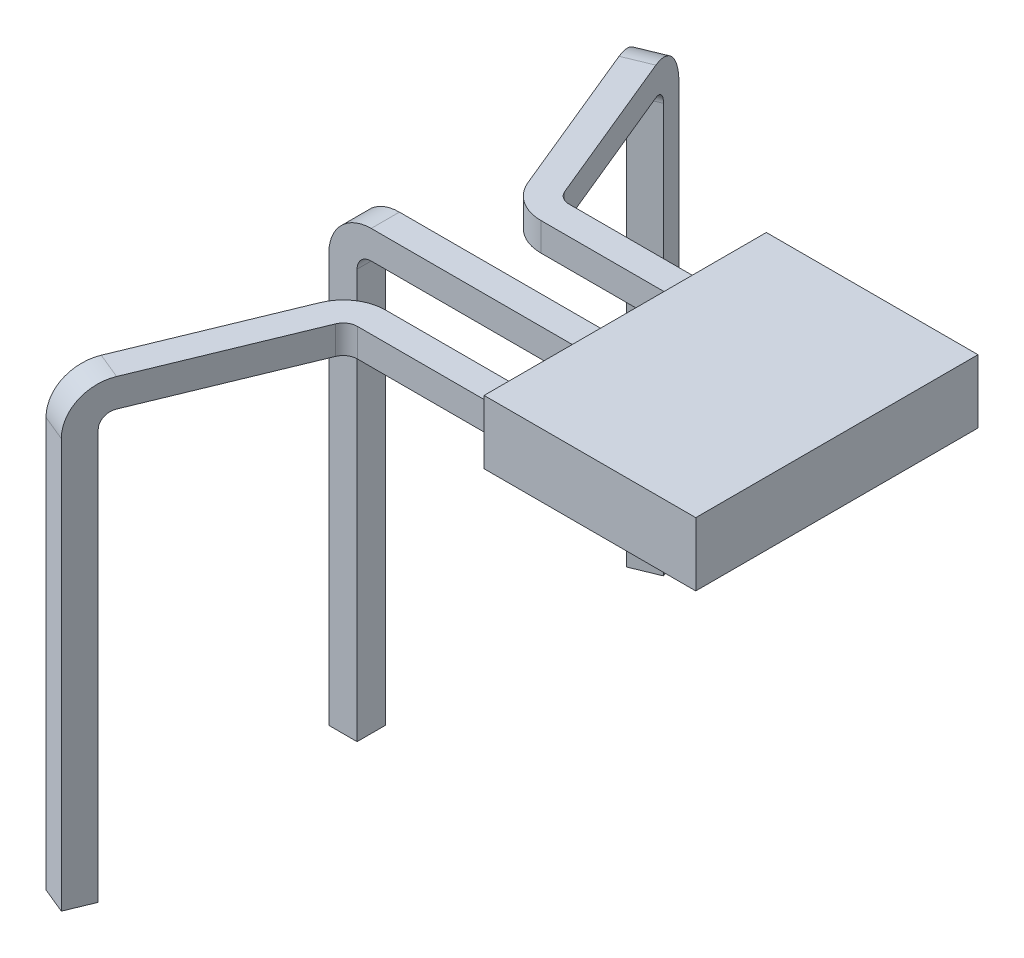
ISO-10303-21;
HEADER;
FILE_DESCRIPTION(('STEP AP214'),'2;1');
FILE_NAME('part.step','',(''),(''),'','','');
FILE_SCHEMA(('AUTOMOTIVE_DESIGN { 1 0 10303 214 1 1 1 1 }'));
ENDSEC;
DATA;
#1=APPLICATION_CONTEXT('core data for automotive mechanical design processes');
#2=APPLICATION_PROTOCOL_DEFINITION('international standard','automotive_design',2000,#1);
#3=PRODUCT_CONTEXT('',#1,'mechanical');
#4=PRODUCT('Part','Part','',(#3));
#5=PRODUCT_RELATED_PRODUCT_CATEGORY('part','',(#4));
#6=PRODUCT_DEFINITION_FORMATION('','',#4);
#7=PRODUCT_DEFINITION_CONTEXT('part definition',#1,'design');
#8=PRODUCT_DEFINITION('design','',#6,#7);
#9=PRODUCT_DEFINITION_SHAPE('','',#8);
#10=(LENGTH_UNIT() NAMED_UNIT(*) SI_UNIT(.MILLI.,.METRE.));
#11=(NAMED_UNIT(*) PLANE_ANGLE_UNIT() SI_UNIT($,.RADIAN.));
#12=(NAMED_UNIT(*) SI_UNIT($,.STERADIAN.) SOLID_ANGLE_UNIT());
#13=UNCERTAINTY_MEASURE_WITH_UNIT(LENGTH_MEASURE(1.E-05),#10,'distance_accuracy_value','');
#14=(GEOMETRIC_REPRESENTATION_CONTEXT(3) GLOBAL_UNCERTAINTY_ASSIGNED_CONTEXT((#13)) GLOBAL_UNIT_ASSIGNED_CONTEXT((#10,
#11,#12)) REPRESENTATION_CONTEXT('',''));
#15=CARTESIAN_POINT('',(0.,0.,0.));
#16=DIRECTION('',(0.,0.,1.));
#17=DIRECTION('',(1.,0.,0.));
#18=AXIS2_PLACEMENT_3D('',#15,#16,#17);
#19=CARTESIAN_POINT('',(-4.,0.550000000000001,-0.200000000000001));
#20=DIRECTION('',(0.,1.,0.));
#21=DIRECTION('',(0.,0.,1.));
#22=AXIS2_PLACEMENT_3D('',#19,#20,#21);
#23=PLANE('',#22);
#24=DIRECTION('',(1.,0.,0.));
#25=VECTOR('',#24,1.);
#26=CARTESIAN_POINT('',(-4.,0.549999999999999,0.199999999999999));
#27=LINE('',#26,#25);
#28=CARTESIAN_POINT('',(-3.4,0.549999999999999,0.199999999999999));
#29=VERTEX_POINT('',#28);
#30=CARTESIAN_POINT('',(0.,0.549999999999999,0.199999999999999));
#31=VERTEX_POINT('',#30);
#32=EDGE_CURVE('E324',#29,#31,#27,.T.);
#33=ORIENTED_EDGE('',*,*,#32,.F.);
#34=DIRECTION('',(0.,0.,1.));
#35=VECTOR('',#34,1.);
#36=CARTESIAN_POINT('',(-3.4,0.550000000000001,-0.200000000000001));
#37=LINE('',#36,#35);
#38=CARTESIAN_POINT('',(-3.4,0.550000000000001,-0.200000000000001));
#39=VERTEX_POINT('',#38);
#40=EDGE_CURVE('E557',#29,#39,#37,.F.);
#41=ORIENTED_EDGE('',*,*,#40,.T.);
#42=DIRECTION('',(1.,0.,0.));
#43=VECTOR('',#42,1.);
#44=CARTESIAN_POINT('',(-4.,0.550000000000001,-0.200000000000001));
#45=LINE('',#44,#43);
#46=CARTESIAN_POINT('',(0.,0.550000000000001,-0.200000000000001));
#47=VERTEX_POINT('',#46);
#48=EDGE_CURVE('E326',#39,#47,#45,.T.);
#49=ORIENTED_EDGE('',*,*,#48,.T.);
#50=DIRECTION('',(0.,0.,1.));
#51=VECTOR('',#50,1.);
#52=CARTESIAN_POINT('',(0.,0.550000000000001,-0.200000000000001));
#53=LINE('',#52,#51);
#54=EDGE_CURVE('E313',#47,#31,#53,.T.);
#55=ORIENTED_EDGE('',*,*,#54,.T.);
#56=EDGE_LOOP('',(#33,#41,#49,#55));
#57=FACE_BOUND('',#56,.T.);
#58=ADVANCED_FACE('F33',(#57),#23,.F.);
#59=CARTESIAN_POINT('',(0.,1.5,2.));
#60=DIRECTION('',(1.,0.,0.));
#61=DIRECTION('',(0.,0.,-1.));
#62=AXIS2_PLACEMENT_3D('',#59,#60,#61);
#63=PLANE('',#62);
#64=DIRECTION('',(0.,0.,1.));
#65=VECTOR('',#64,1.);
#66=CARTESIAN_POINT('',(0.,0.550000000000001,1.5));
#67=LINE('',#66,#65);
#68=CARTESIAN_POINT('',(0.,0.549999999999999,1.1));
#69=VERTEX_POINT('',#68);
#70=CARTESIAN_POINT('',(0.,0.550000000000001,1.5));
#71=VERTEX_POINT('',#70);
#72=EDGE_CURVE('E406',#69,#71,#67,.T.);
#73=ORIENTED_EDGE('',*,*,#72,.F.);
#74=DIRECTION('',(0.,-1.,0.));
#75=VECTOR('',#74,1.);
#76=CARTESIAN_POINT('',(0.,0.549999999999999,1.1));
#77=LINE('',#76,#75);
#78=CARTESIAN_POINT('',(0.,0.949999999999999,1.1));
#79=VERTEX_POINT('',#78);
#80=EDGE_CURVE('E398',#79,#69,#77,.T.);
#81=ORIENTED_EDGE('',*,*,#80,.F.);
#82=DIRECTION('',(0.,0.,-1.));
#83=VECTOR('',#82,1.);
#84=CARTESIAN_POINT('',(0.,0.949999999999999,1.1));
#85=LINE('',#84,#83);
#86=CARTESIAN_POINT('',(0.,0.950000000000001,1.5));
#87=VERTEX_POINT('',#86);
#88=EDGE_CURVE('E412',#87,#79,#85,.T.);
#89=ORIENTED_EDGE('',*,*,#88,.F.);
#90=DIRECTION('',(0.,1.,0.));
#91=VECTOR('',#90,1.);
#92=CARTESIAN_POINT('',(0.,0.950000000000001,1.5));
#93=LINE('',#92,#91);
#94=EDGE_CURVE('E409',#71,#87,#93,.T.);
#95=ORIENTED_EDGE('',*,*,#94,.F.);
#96=EDGE_LOOP('',(#73,#81,#89,#95));
#97=FACE_BOUND('',#96,.T.);
#98=DIRECTION('',(0.,-1.,0.));
#99=VECTOR('',#98,1.);
#100=CARTESIAN_POINT('',(0.,1.5,-2.));
#101=LINE('',#100,#99);
#102=CARTESIAN_POINT('',(0.,1.5,-2.));
#103=VERTEX_POINT('',#102);
#104=CARTESIAN_POINT('',(0.,0.6,-2.));
#105=VERTEX_POINT('',#104);
#106=EDGE_CURVE('E445',#103,#105,#101,.T.);
#107=ORIENTED_EDGE('',*,*,#106,.T.);
#108=DIRECTION('',(0.,-0.707106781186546,0.707106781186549));
#109=VECTOR('',#108,1.);
#110=CARTESIAN_POINT('',(0.,0.599999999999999,-2.));
#111=LINE('',#110,#109);
#112=CARTESIAN_POINT('',(0.,0.,-1.4));
#113=VERTEX_POINT('',#112);
#114=EDGE_CURVE('E465',#105,#113,#111,.T.);
#115=ORIENTED_EDGE('',*,*,#114,.T.);
#116=DIRECTION('',(0.,0.,1.));
#117=VECTOR('',#116,1.);
#118=CARTESIAN_POINT('',(0.,0.,2.));
#119=LINE('',#118,#117);
#120=CARTESIAN_POINT('',(0.,0.,1.4));
#121=VERTEX_POINT('',#120);
#122=EDGE_CURVE('E439',#113,#121,#119,.T.);
#123=ORIENTED_EDGE('',*,*,#122,.T.);
#124=DIRECTION('',(0.,0.707106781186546,0.707106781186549));
#125=VECTOR('',#124,1.);
#126=CARTESIAN_POINT('',(0.,0.599999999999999,2.));
#127=LINE('',#126,#125);
#128=CARTESIAN_POINT('',(0.,0.6,2.));
#129=VERTEX_POINT('',#128);
#130=EDGE_CURVE('E463',#121,#129,#127,.T.);
#131=ORIENTED_EDGE('',*,*,#130,.T.);
#132=DIRECTION('',(0.,-1.,0.));
#133=VECTOR('',#132,1.);
#134=CARTESIAN_POINT('',(0.,1.5,2.));
#135=LINE('',#134,#133);
#136=CARTESIAN_POINT('',(0.,1.5,2.));
#137=VERTEX_POINT('',#136);
#138=EDGE_CURVE('E457',#137,#129,#135,.T.);
#139=ORIENTED_EDGE('',*,*,#138,.F.);
#140=DIRECTION('',(0.,0.,1.));
#141=VECTOR('',#140,1.);
#142=CARTESIAN_POINT('',(0.,1.5,2.));
#143=LINE('',#142,#141);
#144=EDGE_CURVE('E435',#103,#137,#143,.T.);
#145=ORIENTED_EDGE('',*,*,#144,.F.);
#146=EDGE_LOOP('',(#107,#115,#123,#131,#139,#145));
#147=FACE_BOUND('',#146,.T.);
#148=DIRECTION('',(0.,0.,1.));
#149=VECTOR('',#148,1.);
#150=CARTESIAN_POINT('',(0.,0.949999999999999,-1.1));
#151=LINE('',#150,#149);
#152=CARTESIAN_POINT('',(0.,0.950000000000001,-1.5));
#153=VERTEX_POINT('',#152);
#154=CARTESIAN_POINT('',(0.,0.949999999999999,-1.1));
#155=VERTEX_POINT('',#154);
#156=EDGE_CURVE('E356',#153,#155,#151,.T.);
#157=ORIENTED_EDGE('',*,*,#156,.T.);
#158=DIRECTION('',(0.,-1.,0.));
#159=VECTOR('',#158,1.);
#160=CARTESIAN_POINT('',(0.,0.549999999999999,-1.1));
#161=LINE('',#160,#159);
#162=CARTESIAN_POINT('',(0.,0.549999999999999,-1.1));
#163=VERTEX_POINT('',#162);
#164=EDGE_CURVE('E346',#155,#163,#161,.T.);
#165=ORIENTED_EDGE('',*,*,#164,.T.);
#166=DIRECTION('',(0.,0.,-1.));
#167=VECTOR('',#166,1.);
#168=CARTESIAN_POINT('',(0.,0.550000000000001,-1.5));
#169=LINE('',#168,#167);
#170=CARTESIAN_POINT('',(0.,0.550000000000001,-1.5));
#171=VERTEX_POINT('',#170);
#172=EDGE_CURVE('E362',#163,#171,#169,.T.);
#173=ORIENTED_EDGE('',*,*,#172,.T.);
#174=DIRECTION('',(0.,1.,0.));
#175=VECTOR('',#174,1.);
#176=CARTESIAN_POINT('',(0.,0.950000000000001,-1.5));
#177=LINE('',#176,#175);
#178=EDGE_CURVE('E359',#171,#153,#177,.T.);
#179=ORIENTED_EDGE('',*,*,#178,.T.);
#180=EDGE_LOOP('',(#157,#165,#173,#179));
#181=FACE_BOUND('',#180,.T.);
#182=DIRECTION('',(0.,-1.,0.));
#183=VECTOR('',#182,1.);
#184=CARTESIAN_POINT('',(0.,0.950000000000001,-0.199999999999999));
#185=LINE('',#184,#183);
#186=CARTESIAN_POINT('',(0.,0.950000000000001,-0.199999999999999));
#187=VERTEX_POINT('',#186);
#188=EDGE_CURVE('E307',#187,#47,#185,.T.);
#189=ORIENTED_EDGE('',*,*,#188,.F.);
#190=DIRECTION('',(0.,0.,-1.));
#191=VECTOR('',#190,1.);
#192=CARTESIAN_POINT('',(0.,0.949999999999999,0.200000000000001));
#193=LINE('',#192,#191);
#194=CARTESIAN_POINT('',(0.,0.949999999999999,0.200000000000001));
#195=VERTEX_POINT('',#194);
#196=EDGE_CURVE('E285',#195,#187,#193,.T.);
#197=ORIENTED_EDGE('',*,*,#196,.F.);
#198=DIRECTION('',(0.,1.,0.));
#199=VECTOR('',#198,1.);
#200=CARTESIAN_POINT('',(0.,0.549999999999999,0.199999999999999));
#201=LINE('',#200,#199);
#202=EDGE_CURVE('E316',#31,#195,#201,.T.);
#203=ORIENTED_EDGE('',*,*,#202,.F.);
#204=ORIENTED_EDGE('',*,*,#54,.F.);
#205=EDGE_LOOP('',(#189,#197,#203,#204));
#206=FACE_BOUND('',#205,.T.);
#207=ADVANCED_FACE('F581',(#97,#147,#181,#206),#63,.F.);
#208=CARTESIAN_POINT('',(-3.12960678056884,0.550000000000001,1.5));
#209=DIRECTION('',(0.,1.,0.));
#210=DIRECTION('',(0.,0.,1.));
#211=AXIS2_PLACEMENT_3D('',#208,#209,#210);
#212=PLANE('',#211);
#213=DIRECTION('',(-0.380956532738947,0.,0.924592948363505));
#214=VECTOR('',#213,1.);
#215=CARTESIAN_POINT('',(-2.43001519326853,0.550000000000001,1.5));
#216=LINE('',#215,#214);
#217=CARTESIAN_POINT('',(-2.48102762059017,0.550000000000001,1.62380869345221));
#218=VERTEX_POINT('',#217);
#219=CARTESIAN_POINT('',(-3.38650749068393,0.550000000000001,3.82143553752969));
#220=VERTEX_POINT('',#219);
#221=EDGE_CURVE('E431',#218,#220,#216,.T.);
#222=ORIENTED_EDGE('',*,*,#221,.T.);
#223=DIRECTION('',(0.924592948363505,0.,0.380956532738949));
#224=VECTOR('',#223,1.);
#225=CARTESIAN_POINT('',(-3.75634467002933,0.550000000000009,3.66905292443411));
#226=LINE('',#225,#224);
#227=CARTESIAN_POINT('',(-3.75634467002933,0.549999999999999,3.66905292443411));
#228=VERTEX_POINT('',#227);
#229=EDGE_CURVE('E502',#220,#228,#226,.F.);
#230=ORIENTED_EDGE('',*,*,#229,.T.);
#231=DIRECTION('',(-0.380956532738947,0.,0.924592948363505));
#232=VECTOR('',#231,1.);
#233=CARTESIAN_POINT('',(-2.69782751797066,0.549999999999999,1.1));
#234=LINE('',#233,#232);
#235=CARTESIAN_POINT('',(-2.85086479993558,0.549999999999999,1.47142608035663));
#236=VERTEX_POINT('',#235);
#237=EDGE_CURVE('E423',#236,#228,#234,.T.);
#238=ORIENTED_EDGE('',*,*,#237,.F.);
#239=CARTESIAN_POINT('',(-2.29610903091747,0.550000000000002,1.7));
#240=DIRECTION('',(0.,1.,0.));
#241=DIRECTION('',(0.,0.,1.));
#242=AXIS2_PLACEMENT_3D('',#239,#240,#241);
#243=CIRCLE('',#242,0.6);
#244=CARTESIAN_POINT('',(-2.29610903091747,0.549999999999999,1.1));
#245=VERTEX_POINT('',#244);
#246=EDGE_CURVE('E495',#236,#245,#243,.F.);
#247=ORIENTED_EDGE('',*,*,#246,.T.);
#248=DIRECTION('',(1.,0.,0.));
#249=VECTOR('',#248,1.);
#250=CARTESIAN_POINT('',(-3.12960678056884,0.549999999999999,1.1));
#251=LINE('',#250,#249);
#252=EDGE_CURVE('E421',#245,#69,#251,.T.);
#253=ORIENTED_EDGE('',*,*,#252,.T.);
#254=ORIENTED_EDGE('',*,*,#72,.T.);
#255=DIRECTION('',(1.,0.,0.));
#256=VECTOR('',#255,1.);
#257=CARTESIAN_POINT('',(-3.12960678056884,0.550000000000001,1.5));
#258=LINE('',#257,#256);
#259=CARTESIAN_POINT('',(-2.29610903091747,0.550000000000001,1.5));
#260=VERTEX_POINT('',#259);
#261=EDGE_CURVE('E419',#260,#71,#258,.T.);
#262=ORIENTED_EDGE('',*,*,#261,.F.);
#263=CARTESIAN_POINT('',(-2.29610903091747,0.550000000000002,1.7));
#264=DIRECTION('',(0.,1.,0.));
#265=DIRECTION('',(0.,0.,1.));
#266=AXIS2_PLACEMENT_3D('',#263,#264,#265);
#267=CIRCLE('',#266,0.2);
#268=EDGE_CURVE('E515',#260,#218,#267,.T.);
#269=ORIENTED_EDGE('',*,*,#268,.T.);
#270=EDGE_LOOP('',(#222,#230,#238,#247,#253,#254,#262,#269));
#271=FACE_BOUND('',#270,.T.);
#272=ADVANCED_FACE('F595',(#271),#212,.F.);
#273=CARTESIAN_POINT('',(0.,1.5,2.));
#274=DIRECTION('',(0.,0.,-1.));
#275=DIRECTION('',(-1.,0.,0.));
#276=AXIS2_PLACEMENT_3D('',#273,#274,#275);
#277=PLANE('',#276);
#278=ORIENTED_EDGE('',*,*,#138,.T.);
#279=DIRECTION('',(1.,0.,0.));
#280=VECTOR('',#279,1.);
#281=CARTESIAN_POINT('',(3.,0.599999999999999,2.));
#282=LINE('',#281,#280);
#283=CARTESIAN_POINT('',(3.,0.599999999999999,2.));
#284=VERTEX_POINT('',#283);
#285=EDGE_CURVE('E475',#129,#284,#282,.T.);
#286=ORIENTED_EDGE('',*,*,#285,.T.);
#287=DIRECTION('',(0.,-1.,0.));
#288=VECTOR('',#287,1.);
#289=CARTESIAN_POINT('',(3.,1.5,2.));
#290=LINE('',#289,#288);
#291=CARTESIAN_POINT('',(3.,1.5,2.));
#292=VERTEX_POINT('',#291);
#293=EDGE_CURVE('E454',#292,#284,#290,.T.);
#294=ORIENTED_EDGE('',*,*,#293,.F.);
#295=DIRECTION('',(1.,0.,0.));
#296=VECTOR('',#295,1.);
#297=CARTESIAN_POINT('',(0.,1.5,2.));
#298=LINE('',#297,#296);
#299=EDGE_CURVE('E438',#137,#292,#298,.T.);
#300=ORIENTED_EDGE('',*,*,#299,.F.);
#301=EDGE_LOOP('',(#278,#286,#294,#300));
#302=FACE_BOUND('',#301,.T.);
#303=ADVANCED_FACE('F667',(#302),#277,.F.);
#304=CARTESIAN_POINT('',(3.,1.5,2.));
#305=DIRECTION('',(-1.,0.,0.));
#306=DIRECTION('',(0.,0.,1.));
#307=AXIS2_PLACEMENT_3D('',#304,#305,#306);
#308=PLANE('',#307);
#309=ORIENTED_EDGE('',*,*,#293,.T.);
#310=DIRECTION('',(0.,0.,-1.));
#311=VECTOR('',#310,1.);
#312=CARTESIAN_POINT('',(3.,0.599999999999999,-2.));
#313=LINE('',#312,#311);
#314=CARTESIAN_POINT('',(3.,0.599999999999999,-2.));
#315=VERTEX_POINT('',#314);
#316=EDGE_CURVE('E473',#284,#315,#313,.T.);
#317=ORIENTED_EDGE('',*,*,#316,.T.);
#318=DIRECTION('',(0.,-1.,0.));
#319=VECTOR('',#318,1.);
#320=CARTESIAN_POINT('',(3.,1.5,-2.));
#321=LINE('',#320,#319);
#322=CARTESIAN_POINT('',(3.,1.5,-2.));
#323=VERTEX_POINT('',#322);
#324=EDGE_CURVE('E451',#323,#315,#321,.T.);
#325=ORIENTED_EDGE('',*,*,#324,.F.);
#326=DIRECTION('',(0.,0.,-1.));
#327=VECTOR('',#326,1.);
#328=CARTESIAN_POINT('',(3.,1.5,2.));
#329=LINE('',#328,#327);
#330=EDGE_CURVE('E441',#292,#323,#329,.T.);
#331=ORIENTED_EDGE('',*,*,#330,.F.);
#332=EDGE_LOOP('',(#309,#317,#325,#331));
#333=FACE_BOUND('',#332,.T.);
#334=ADVANCED_FACE('F692',(#333),#308,.F.);
#335=CARTESIAN_POINT('',(0.,1.5,-2.));
#336=DIRECTION('',(0.,0.,1.));
#337=DIRECTION('',(1.,0.,0.));
#338=AXIS2_PLACEMENT_3D('',#335,#336,#337);
#339=PLANE('',#338);
#340=ORIENTED_EDGE('',*,*,#324,.T.);
#341=DIRECTION('',(-1.,0.,0.));
#342=VECTOR('',#341,1.);
#343=CARTESIAN_POINT('',(0.,0.599999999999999,-2.));
#344=LINE('',#343,#342);
#345=EDGE_CURVE('E460',#315,#105,#344,.T.);
#346=ORIENTED_EDGE('',*,*,#345,.T.);
#347=ORIENTED_EDGE('',*,*,#106,.F.);
#348=DIRECTION('',(-1.,0.,0.));
#349=VECTOR('',#348,1.);
#350=CARTESIAN_POINT('',(0.,1.5,-2.));
#351=LINE('',#350,#349);
#352=EDGE_CURVE('E443',#323,#103,#351,.T.);
#353=ORIENTED_EDGE('',*,*,#352,.F.);
#354=EDGE_LOOP('',(#340,#346,#347,#353));
#355=FACE_BOUND('',#354,.T.);
#356=ADVANCED_FACE('F684',(#355),#339,.F.);
#357=CARTESIAN_POINT('',(0.,1.5,-2.));
#358=DIRECTION('',(0.,-1.,0.));
#359=DIRECTION('',(0.,0.,-1.));
#360=AXIS2_PLACEMENT_3D('',#357,#358,#359);
#361=PLANE('',#360);
#362=ORIENTED_EDGE('',*,*,#144,.T.);
#363=ORIENTED_EDGE('',*,*,#299,.T.);
#364=ORIENTED_EDGE('',*,*,#330,.T.);
#365=ORIENTED_EDGE('',*,*,#352,.T.);
#366=EDGE_LOOP('',(#362,#363,#364,#365));
#367=FACE_BOUND('',#366,.T.);
#368=ADVANCED_FACE('F680',(#367),#361,.F.);
#369=CARTESIAN_POINT('',(0.,0.,-2.));
#370=DIRECTION('',(0.,-1.,0.));
#371=DIRECTION('',(0.,0.,-1.));
#372=AXIS2_PLACEMENT_3D('',#369,#370,#371);
#373=PLANE('',#372);
#374=ORIENTED_EDGE('',*,*,#122,.F.);
#375=DIRECTION('',(1.,0.,0.));
#376=VECTOR('',#375,1.);
#377=CARTESIAN_POINT('',(3.,0.,-1.4));
#378=LINE('',#377,#376);
#379=CARTESIAN_POINT('',(2.4,0.,-1.4));
#380=VERTEX_POINT('',#379);
#381=EDGE_CURVE('E471',#113,#380,#378,.T.);
#382=ORIENTED_EDGE('',*,*,#381,.T.);
#383=DIRECTION('',(0.,0.,1.));
#384=VECTOR('',#383,1.);
#385=CARTESIAN_POINT('',(2.4,0.,2.));
#386=LINE('',#385,#384);
#387=CARTESIAN_POINT('',(2.4,0.,1.4));
#388=VERTEX_POINT('',#387);
#389=EDGE_CURVE('E469',#380,#388,#386,.T.);
#390=ORIENTED_EDGE('',*,*,#389,.T.);
#391=DIRECTION('',(-1.,0.,0.));
#392=VECTOR('',#391,1.);
#393=CARTESIAN_POINT('',(0.,0.,1.4));
#394=LINE('',#393,#392);
#395=EDGE_CURVE('E467',#388,#121,#394,.T.);
#396=ORIENTED_EDGE('',*,*,#395,.T.);
#397=EDGE_LOOP('',(#374,#382,#390,#396));
#398=FACE_BOUND('',#397,.T.);
#399=ADVANCED_FACE('F683',(#398),#373,.T.);
#400=CARTESIAN_POINT('',(0.,0.599999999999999,2.));
#401=DIRECTION('',(0.,-0.707106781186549,0.707106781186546));
#402=DIRECTION('',(0.,-0.707106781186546,-0.707106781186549));
#403=AXIS2_PLACEMENT_3D('',#400,#401,#402);
#404=PLANE('',#403);
#405=ORIENTED_EDGE('',*,*,#130,.F.);
#406=ORIENTED_EDGE('',*,*,#395,.F.);
#407=DIRECTION('',(0.577350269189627,0.577350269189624,0.577350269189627));
#408=VECTOR('',#407,1.);
#409=CARTESIAN_POINT('',(2.,-0.399999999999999,0.999999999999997));
#410=LINE('',#409,#408);
#411=EDGE_CURVE('E448',#284,#388,#410,.F.);
#412=ORIENTED_EDGE('',*,*,#411,.F.);
#413=ORIENTED_EDGE('',*,*,#285,.F.);
#414=EDGE_LOOP('',(#405,#406,#412,#413));
#415=FACE_BOUND('',#414,.T.);
#416=ADVANCED_FACE('F688',(#415),#404,.T.);
#417=CARTESIAN_POINT('',(3.,0.599999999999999,2.));
#418=DIRECTION('',(0.707106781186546,-0.707106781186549,0.));
#419=DIRECTION('',(0.707106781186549,0.707106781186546,0.));
#420=AXIS2_PLACEMENT_3D('',#417,#418,#419);
#421=PLANE('',#420);
#422=ORIENTED_EDGE('',*,*,#411,.T.);
#423=ORIENTED_EDGE('',*,*,#389,.F.);
#424=DIRECTION('',(0.577350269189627,0.577350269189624,-0.577350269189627));
#425=VECTOR('',#424,1.);
#426=CARTESIAN_POINT('',(1.66666666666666,-0.733333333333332,-0.666666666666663));
#427=LINE('',#426,#425);
#428=EDGE_CURVE('E402',#315,#380,#427,.F.);
#429=ORIENTED_EDGE('',*,*,#428,.F.);
#430=ORIENTED_EDGE('',*,*,#316,.F.);
#431=EDGE_LOOP('',(#422,#423,#429,#430));
#432=FACE_BOUND('',#431,.T.);
#433=ADVANCED_FACE('F702',(#432),#421,.T.);
#434=CARTESIAN_POINT('',(0.,0.599999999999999,-2.));
#435=DIRECTION('',(0.,-0.707106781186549,-0.707106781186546));
#436=DIRECTION('',(0.,0.707106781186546,-0.707106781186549));
#437=AXIS2_PLACEMENT_3D('',#434,#435,#436);
#438=PLANE('',#437);
#439=ORIENTED_EDGE('',*,*,#428,.T.);
#440=ORIENTED_EDGE('',*,*,#381,.F.);
#441=ORIENTED_EDGE('',*,*,#114,.F.);
#442=ORIENTED_EDGE('',*,*,#345,.F.);
#443=EDGE_LOOP('',(#439,#440,#441,#442));
#444=FACE_BOUND('',#443,.T.);
#445=ADVANCED_FACE('F675',(#444),#438,.T.);
#446=CARTESIAN_POINT('',(-2.69782751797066,0.550000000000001,1.1));
#447=DIRECTION('',(-0.924592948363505,0.,-0.380956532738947));
#448=DIRECTION('',(-0.380956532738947,0.,0.924592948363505));
#449=AXIS2_PLACEMENT_3D('',#446,#447,#448);
#450=PLANE('',#449);
#451=DIRECTION('',(0.,1.,0.));
#452=VECTOR('',#451,1.);
#453=CARTESIAN_POINT('',(-3.9849185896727,0.550000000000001,4.22380869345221));
#454=LINE('',#453,#452);
#455=CARTESIAN_POINT('',(-3.9849185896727,-5.44999999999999,4.22380869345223));
#456=VERTEX_POINT('',#455);
#457=CARTESIAN_POINT('',(-3.9849185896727,0.35000000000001,4.22380869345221));
#458=VERTEX_POINT('',#457);
#459=EDGE_CURVE('E399',#456,#458,#454,.T.);
#460=ORIENTED_EDGE('',*,*,#459,.T.);
#461=CARTESIAN_POINT('',(-3.75634467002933,0.35000000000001,3.66905292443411));
#462=DIRECTION('',(-0.924592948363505,0.,-0.380956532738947));
#463=DIRECTION('',(-0.380956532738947,0.,0.924592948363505));
#464=AXIS2_PLACEMENT_3D('',#461,#462,#463);
#465=CIRCLE('',#464,0.6);
#466=CARTESIAN_POINT('',(-3.75634467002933,0.949999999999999,3.66905292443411));
#467=VERTEX_POINT('',#466);
#468=EDGE_CURVE('E493',#458,#467,#465,.T.);
#469=ORIENTED_EDGE('',*,*,#468,.T.);
#470=DIRECTION('',(-0.380956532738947,0.,0.924592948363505));
#471=VECTOR('',#470,1.);
#472=CARTESIAN_POINT('',(-2.69782751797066,0.949999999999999,1.1));
#473=LINE('',#472,#471);
#474=CARTESIAN_POINT('',(-2.85086479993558,0.949999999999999,1.47142608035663));
#475=VERTEX_POINT('',#474);
#476=EDGE_CURVE('E426',#475,#467,#473,.T.);
#477=ORIENTED_EDGE('',*,*,#476,.F.);
#478=DIRECTION('',(0.,-1.,0.));
#479=VECTOR('',#478,1.);
#480=CARTESIAN_POINT('',(-2.85086479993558,0.550000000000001,1.47142608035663));
#481=LINE('',#480,#479);
#482=EDGE_CURVE('E490',#475,#236,#481,.T.);
#483=ORIENTED_EDGE('',*,*,#482,.T.);
#484=ORIENTED_EDGE('',*,*,#237,.T.);
#485=CARTESIAN_POINT('',(-3.75634467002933,0.350000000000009,3.66905292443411));
#486=DIRECTION('',(-0.924592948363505,0.,-0.380956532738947));
#487=DIRECTION('',(-0.380956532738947,0.,0.924592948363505));
#488=AXIS2_PLACEMENT_3D('',#485,#486,#487);
#489=CIRCLE('',#488,0.2);
#490=CARTESIAN_POINT('',(-3.83253597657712,0.35000000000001,3.85397151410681));
#491=VERTEX_POINT('',#490);
#492=EDGE_CURVE('E511',#228,#491,#489,.F.);
#493=ORIENTED_EDGE('',*,*,#492,.T.);
#494=DIRECTION('',(0.,1.,0.));
#495=VECTOR('',#494,1.);
#496=CARTESIAN_POINT('',(-3.83253597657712,-5.44999999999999,3.85397151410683));
#497=LINE('',#496,#495);
#498=CARTESIAN_POINT('',(-3.83253597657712,-5.44999999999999,3.85397151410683));
#499=VERTEX_POINT('',#498);
#500=EDGE_CURVE('E395',#499,#491,#497,.T.);
#501=ORIENTED_EDGE('',*,*,#500,.F.);
#502=DIRECTION('',(0.380956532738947,0.,-0.924592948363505));
#503=VECTOR('',#502,1.);
#504=CARTESIAN_POINT('',(-3.9849185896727,-5.44999999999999,4.22380869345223));
#505=LINE('',#504,#503);
#506=EDGE_CURVE('E388',#456,#499,#505,.T.);
#507=ORIENTED_EDGE('',*,*,#506,.F.);
#508=EDGE_LOOP('',(#460,#469,#477,#483,#484,#493,#501,#507));
#509=FACE_BOUND('',#508,.T.);
#510=ADVANCED_FACE('F672',(#509),#450,.T.);
#511=CARTESIAN_POINT('',(-2.43001519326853,0.950000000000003,1.5));
#512=DIRECTION('',(0.924592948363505,0.,0.380956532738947));
#513=DIRECTION('',(0.380956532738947,0.,-0.924592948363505));
#514=AXIS2_PLACEMENT_3D('',#511,#512,#513);
#515=PLANE('',#514);
#516=ORIENTED_EDGE('',*,*,#221,.F.);
#517=DIRECTION('',(0.,1.,0.));
#518=VECTOR('',#517,1.);
#519=CARTESIAN_POINT('',(-2.48102762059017,0.950000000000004,1.62380869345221));
#520=LINE('',#519,#518);
#521=CARTESIAN_POINT('',(-2.48102762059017,0.950000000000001,1.62380869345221));
#522=VERTEX_POINT('',#521);
#523=EDGE_CURVE('E504',#218,#522,#520,.T.);
#524=ORIENTED_EDGE('',*,*,#523,.T.);
#525=DIRECTION('',(-0.380956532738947,0.,0.924592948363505));
#526=VECTOR('',#525,1.);
#527=CARTESIAN_POINT('',(-2.43001519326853,0.950000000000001,1.5));
#528=LINE('',#527,#526);
#529=CARTESIAN_POINT('',(-3.38650749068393,0.950000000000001,3.82143553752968));
#530=VERTEX_POINT('',#529);
#531=EDGE_CURVE('E429',#522,#530,#528,.T.);
#532=ORIENTED_EDGE('',*,*,#531,.T.);
#533=CARTESIAN_POINT('',(-3.38650749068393,0.350000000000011,3.82143553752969));
#534=DIRECTION('',(0.924592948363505,0.,0.380956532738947));
#535=DIRECTION('',(0.380956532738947,0.,-0.924592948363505));
#536=AXIS2_PLACEMENT_3D('',#533,#534,#535);
#537=CIRCLE('',#536,0.6);
#538=CARTESIAN_POINT('',(-3.6150814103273,0.350000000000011,4.37619130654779));
#539=VERTEX_POINT('',#538);
#540=EDGE_CURVE('E486',#530,#539,#537,.T.);
#541=ORIENTED_EDGE('',*,*,#540,.T.);
#542=DIRECTION('',(0.,-1.,0.));
#543=VECTOR('',#542,1.);
#544=CARTESIAN_POINT('',(-3.6150814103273,0.950000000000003,4.37619130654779));
#545=LINE('',#544,#543);
#546=CARTESIAN_POINT('',(-3.6150814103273,-5.44999999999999,4.37619130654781));
#547=VERTEX_POINT('',#546);
#548=EDGE_CURVE('E403',#539,#547,#545,.T.);
#549=ORIENTED_EDGE('',*,*,#548,.T.);
#550=DIRECTION('',(-0.380956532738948,0.,0.924592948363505));
#551=VECTOR('',#550,1.);
#552=CARTESIAN_POINT('',(-3.46269879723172,-5.44999999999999,4.00635412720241));
#553=LINE('',#552,#551);
#554=CARTESIAN_POINT('',(-3.46269879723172,-5.44999999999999,4.00635412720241));
#555=VERTEX_POINT('',#554);
#556=EDGE_CURVE('E353',#555,#547,#553,.T.);
#557=ORIENTED_EDGE('',*,*,#556,.F.);
#558=DIRECTION('',(0.,1.,0.));
#559=VECTOR('',#558,1.);
#560=CARTESIAN_POINT('',(-3.46269879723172,-5.44999999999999,4.00635412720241));
#561=LINE('',#560,#559);
#562=CARTESIAN_POINT('',(-3.46269879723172,0.35000000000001,4.00635412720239));
#563=VERTEX_POINT('',#562);
#564=EDGE_CURVE('E392',#555,#563,#561,.T.);
#565=ORIENTED_EDGE('',*,*,#564,.T.);
#566=CARTESIAN_POINT('',(-3.38650749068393,0.35000000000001,3.82143553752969));
#567=DIRECTION('',(0.924592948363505,0.,0.380956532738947));
#568=DIRECTION('',(0.380956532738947,0.,-0.924592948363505));
#569=AXIS2_PLACEMENT_3D('',#566,#567,#568);
#570=CIRCLE('',#569,0.2);
#571=EDGE_CURVE('E509',#563,#220,#570,.F.);
#572=ORIENTED_EDGE('',*,*,#571,.T.);
#573=EDGE_LOOP('',(#516,#524,#532,#541,#549,#557,#565,#572));
#574=FACE_BOUND('',#573,.T.);
#575=ADVANCED_FACE('F663',(#574),#515,.T.);
#576=CARTESIAN_POINT('',(-3.12960678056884,0.950000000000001,1.5));
#577=DIRECTION('',(0.,0.,-1.));
#578=DIRECTION('',(0.,1.,0.));
#579=AXIS2_PLACEMENT_3D('',#576,#577,#578);
#580=PLANE('',#579);
#581=DIRECTION('',(1.,0.,0.));
#582=VECTOR('',#581,1.);
#583=CARTESIAN_POINT('',(-3.12960678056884,0.950000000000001,1.5));
#584=LINE('',#583,#582);
#585=CARTESIAN_POINT('',(-2.29610903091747,0.950000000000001,1.5));
#586=VERTEX_POINT('',#585);
#587=EDGE_CURVE('E417',#586,#87,#584,.T.);
#588=ORIENTED_EDGE('',*,*,#587,.F.);
#589=DIRECTION('',(0.,1.,0.));
#590=VECTOR('',#589,1.);
#591=CARTESIAN_POINT('',(-2.29610903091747,0.950000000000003,1.5));
#592=LINE('',#591,#590);
#593=EDGE_CURVE('E507',#586,#260,#592,.F.);
#594=ORIENTED_EDGE('',*,*,#593,.T.);
#595=ORIENTED_EDGE('',*,*,#261,.T.);
#596=ORIENTED_EDGE('',*,*,#94,.T.);
#597=EDGE_LOOP('',(#588,#594,#595,#596));
#598=FACE_BOUND('',#597,.T.);
#599=ADVANCED_FACE('F659',(#598),#580,.F.);
#600=CARTESIAN_POINT('',(-3.12960678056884,0.949999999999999,1.1));
#601=DIRECTION('',(0.,-1.,0.));
#602=DIRECTION('',(0.,0.,-1.));
#603=AXIS2_PLACEMENT_3D('',#600,#601,#602);
#604=PLANE('',#603);
#605=ORIENTED_EDGE('',*,*,#476,.T.);
#606=DIRECTION('',(0.924592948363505,0.,0.380956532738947));
#607=VECTOR('',#606,1.);
#608=CARTESIAN_POINT('',(-3.38650749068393,0.95000000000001,3.82143553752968));
#609=LINE('',#608,#607);
#610=EDGE_CURVE('E483',#467,#530,#609,.T.);
#611=ORIENTED_EDGE('',*,*,#610,.T.);
#612=ORIENTED_EDGE('',*,*,#531,.F.);
#613=CARTESIAN_POINT('',(-2.29610903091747,0.950000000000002,1.7));
#614=DIRECTION('',(0.,-1.,0.));
#615=DIRECTION('',(0.,0.,-1.));
#616=AXIS2_PLACEMENT_3D('',#613,#614,#615);
#617=CIRCLE('',#616,0.2);
#618=EDGE_CURVE('E513',#522,#586,#617,.T.);
#619=ORIENTED_EDGE('',*,*,#618,.T.);
#620=ORIENTED_EDGE('',*,*,#587,.T.);
#621=ORIENTED_EDGE('',*,*,#88,.T.);
#622=DIRECTION('',(1.,0.,0.));
#623=VECTOR('',#622,1.);
#624=CARTESIAN_POINT('',(-3.12960678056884,0.949999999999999,1.1));
#625=LINE('',#624,#623);
#626=CARTESIAN_POINT('',(-2.29610903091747,0.949999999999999,1.1));
#627=VERTEX_POINT('',#626);
#628=EDGE_CURVE('E415',#627,#79,#625,.T.);
#629=ORIENTED_EDGE('',*,*,#628,.F.);
#630=CARTESIAN_POINT('',(-2.29610903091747,0.950000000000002,1.7));
#631=DIRECTION('',(0.,-1.,0.));
#632=DIRECTION('',(0.,0.,-1.));
#633=AXIS2_PLACEMENT_3D('',#630,#631,#632);
#634=CIRCLE('',#633,0.6);
#635=EDGE_CURVE('E477',#627,#475,#634,.F.);
#636=ORIENTED_EDGE('',*,*,#635,.T.);
#637=EDGE_LOOP('',(#605,#611,#612,#619,#620,#621,#629,#636));
#638=FACE_BOUND('',#637,.T.);
#639=ADVANCED_FACE('F656',(#638),#604,.F.);
#640=CARTESIAN_POINT('',(-3.12960678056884,0.549999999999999,1.1));
#641=DIRECTION('',(0.,0.,1.));
#642=DIRECTION('',(0.,-1.,0.));
#643=AXIS2_PLACEMENT_3D('',#640,#641,#642);
#644=PLANE('',#643);
#645=ORIENTED_EDGE('',*,*,#252,.F.);
#646=DIRECTION('',(0.,-1.,0.));
#647=VECTOR('',#646,1.);
#648=CARTESIAN_POINT('',(-2.29610903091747,0.950000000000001,1.1));
#649=LINE('',#648,#647);
#650=EDGE_CURVE('E497',#245,#627,#649,.F.);
#651=ORIENTED_EDGE('',*,*,#650,.T.);
#652=ORIENTED_EDGE('',*,*,#628,.T.);
#653=ORIENTED_EDGE('',*,*,#80,.T.);
#654=EDGE_LOOP('',(#645,#651,#652,#653));
#655=FACE_BOUND('',#654,.T.);
#656=ADVANCED_FACE('F654',(#655),#644,.F.);
#657=CARTESIAN_POINT('',(-3.8,0.75,4.3));
#658=DIRECTION('',(-0.380956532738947,0.,0.924592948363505));
#659=DIRECTION('',(0.924592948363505,0.,0.380956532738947));
#660=AXIS2_PLACEMENT_3D('',#657,#658,#659);
#661=PLANE('',#660);
#662=ORIENTED_EDGE('',*,*,#548,.F.);
#663=DIRECTION('',(0.924592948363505,0.,0.380956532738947));
#664=VECTOR('',#663,1.);
#665=CARTESIAN_POINT('',(-3.9849185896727,0.35000000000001,4.22380869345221));
#666=LINE('',#665,#664);
#667=EDGE_CURVE('E488',#539,#458,#666,.F.);
#668=ORIENTED_EDGE('',*,*,#667,.T.);
#669=ORIENTED_EDGE('',*,*,#459,.F.);
#670=DIRECTION('',(-0.924592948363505,0.,-0.380956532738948));
#671=VECTOR('',#670,1.);
#672=CARTESIAN_POINT('',(-3.6150814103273,-5.44999999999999,4.37619130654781));
#673=LINE('',#672,#671);
#674=EDGE_CURVE('E385',#547,#456,#673,.T.);
#675=ORIENTED_EDGE('',*,*,#674,.F.);
#676=EDGE_LOOP('',(#662,#668,#669,#675));
#677=FACE_BOUND('',#676,.T.);
#678=ADVANCED_FACE('F650',(#677),#661,.T.);
#679=CARTESIAN_POINT('',(-3.83253597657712,-5.44999999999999,3.85397151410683));
#680=DIRECTION('',(-0.380956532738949,0.,0.924592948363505));
#681=DIRECTION('',(0.924592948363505,0.,0.380956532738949));
#682=AXIS2_PLACEMENT_3D('',#679,#680,#681);
#683=PLANE('',#682);
#684=ORIENTED_EDGE('',*,*,#500,.T.);
#685=DIRECTION('',(0.924592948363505,0.,0.380956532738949));
#686=VECTOR('',#685,1.);
#687=CARTESIAN_POINT('',(-3.46269879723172,0.35000000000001,4.00635412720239));
#688=LINE('',#687,#686);
#689=EDGE_CURVE('E499',#491,#563,#688,.T.);
#690=ORIENTED_EDGE('',*,*,#689,.T.);
#691=ORIENTED_EDGE('',*,*,#564,.F.);
#692=DIRECTION('',(0.924592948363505,0.,0.380956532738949));
#693=VECTOR('',#692,1.);
#694=CARTESIAN_POINT('',(-3.83253597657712,-5.44999999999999,3.85397151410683));
#695=LINE('',#694,#693);
#696=EDGE_CURVE('E390',#499,#555,#695,.T.);
#697=ORIENTED_EDGE('',*,*,#696,.F.);
#698=EDGE_LOOP('',(#684,#690,#691,#697));
#699=FACE_BOUND('',#698,.T.);
#700=ADVANCED_FACE('F646',(#699),#683,.F.);
#701=CARTESIAN_POINT('',(-3.6150814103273,-5.44999999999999,4.37619130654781));
#702=DIRECTION('',(0.,-1.,0.));
#703=DIRECTION('',(0.,0.,-1.));
#704=AXIS2_PLACEMENT_3D('',#701,#702,#703);
#705=PLANE('',#704);
#706=ORIENTED_EDGE('',*,*,#556,.T.);
#707=ORIENTED_EDGE('',*,*,#674,.T.);
#708=ORIENTED_EDGE('',*,*,#506,.T.);
#709=ORIENTED_EDGE('',*,*,#696,.T.);
#710=EDGE_LOOP('',(#706,#707,#708,#709));
#711=FACE_BOUND('',#710,.T.);
#712=ADVANCED_FACE('F642',(#711),#705,.T.);
#713=CARTESIAN_POINT('',(-4.12546072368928,0.350000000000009,3.5169674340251));
#714=DIRECTION('',(-0.924592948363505,0.,-0.380956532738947));
#715=DIRECTION('',(-0.380956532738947,0.,0.924592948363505));
#716=AXIS2_PLACEMENT_3D('',#713,#714,#715);
#717=CYLINDRICAL_SURFACE('',#716,0.6);
#718=ORIENTED_EDGE('',*,*,#468,.F.);
#719=ORIENTED_EDGE('',*,*,#667,.F.);
#720=ORIENTED_EDGE('',*,*,#540,.F.);
#721=ORIENTED_EDGE('',*,*,#610,.F.);
#722=EDGE_LOOP('',(#718,#719,#720,#721));
#723=FACE_BOUND('',#722,.T.);
#724=ADVANCED_FACE('F645',(#723),#717,.T.);
#725=CARTESIAN_POINT('',(-2.29610903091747,0.550000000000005,1.7));
#726=DIRECTION('',(0.,1.,0.));
#727=DIRECTION('',(0.,0.,1.));
#728=AXIS2_PLACEMENT_3D('',#725,#726,#727);
#729=CYLINDRICAL_SURFACE('',#728,0.6);
#730=ORIENTED_EDGE('',*,*,#635,.F.);
#731=ORIENTED_EDGE('',*,*,#650,.F.);
#732=ORIENTED_EDGE('',*,*,#246,.F.);
#733=ORIENTED_EDGE('',*,*,#482,.F.);
#734=EDGE_LOOP('',(#730,#731,#732,#733));
#735=FACE_BOUND('',#734,.T.);
#736=ADVANCED_FACE('F712',(#735),#729,.T.);
#737=CARTESIAN_POINT('',(-3.75634467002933,0.350000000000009,3.66905292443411));
#738=DIRECTION('',(-0.924592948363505,0.,-0.380956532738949));
#739=DIRECTION('',(-0.380956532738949,0.,0.924592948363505));
#740=AXIS2_PLACEMENT_3D('',#737,#738,#739);
#741=CYLINDRICAL_SURFACE('',#740,0.2);
#742=ORIENTED_EDGE('',*,*,#492,.F.);
#743=ORIENTED_EDGE('',*,*,#229,.F.);
#744=ORIENTED_EDGE('',*,*,#571,.F.);
#745=ORIENTED_EDGE('',*,*,#689,.F.);
#746=EDGE_LOOP('',(#742,#743,#744,#745));
#747=FACE_BOUND('',#746,.T.);
#748=ADVANCED_FACE('F716',(#747),#741,.F.);
#749=CARTESIAN_POINT('',(-2.29610903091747,0.950000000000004,1.7));
#750=DIRECTION('',(0.,1.,0.));
#751=DIRECTION('',(0.,0.,1.));
#752=AXIS2_PLACEMENT_3D('',#749,#750,#751);
#753=CYLINDRICAL_SURFACE('',#752,0.2);
#754=ORIENTED_EDGE('',*,*,#268,.F.);
#755=ORIENTED_EDGE('',*,*,#593,.F.);
#756=ORIENTED_EDGE('',*,*,#618,.F.);
#757=ORIENTED_EDGE('',*,*,#523,.F.);
#758=EDGE_LOOP('',(#754,#755,#756,#757));
#759=FACE_BOUND('',#758,.T.);
#760=ADVANCED_FACE('F637',(#759),#753,.F.);
#761=CARTESIAN_POINT('',(-2.69782751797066,0.550000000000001,-1.1));
#762=DIRECTION('',(0.924592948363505,0.,-0.380956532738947));
#763=DIRECTION('',(-0.380956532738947,0.,-0.924592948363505));
#764=AXIS2_PLACEMENT_3D('',#761,#762,#763);
#765=PLANE('',#764);
#766=DIRECTION('',(-0.380956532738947,0.,-0.924592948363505));
#767=VECTOR('',#766,1.);
#768=CARTESIAN_POINT('',(-2.69782751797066,0.95,-1.1));
#769=LINE('',#768,#767);
#770=CARTESIAN_POINT('',(-2.85086479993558,0.95,-1.47142608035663));
#771=VERTEX_POINT('',#770);
#772=CARTESIAN_POINT('',(-3.75634467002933,0.95,-3.66905292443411));
#773=VERTEX_POINT('',#772);
#774=EDGE_CURVE('E350',#771,#773,#769,.T.);
#775=ORIENTED_EDGE('',*,*,#774,.T.);
#776=CARTESIAN_POINT('',(-3.75634467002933,0.35000000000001,-3.66905292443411));
#777=DIRECTION('',(0.924592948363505,0.,-0.380956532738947));
#778=DIRECTION('',(-0.380956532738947,0.,-0.924592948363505));
#779=AXIS2_PLACEMENT_3D('',#776,#777,#778);
#780=CIRCLE('',#779,0.6);
#781=CARTESIAN_POINT('',(-3.9849185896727,0.35000000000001,-4.22380869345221));
#782=VERTEX_POINT('',#781);
#783=EDGE_CURVE('E529',#773,#782,#780,.F.);
#784=ORIENTED_EDGE('',*,*,#783,.T.);
#785=DIRECTION('',(0.,1.,0.));
#786=VECTOR('',#785,1.);
#787=CARTESIAN_POINT('',(-3.9849185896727,0.550000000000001,-4.22380869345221));
#788=LINE('',#787,#786);
#789=CARTESIAN_POINT('',(-3.9849185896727,-5.44999999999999,-4.22380869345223));
#790=VERTEX_POINT('',#789);
#791=EDGE_CURVE('E349',#790,#782,#788,.T.);
#792=ORIENTED_EDGE('',*,*,#791,.F.);
#793=DIRECTION('',(0.380956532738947,0.,0.924592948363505));
#794=VECTOR('',#793,1.);
#795=CARTESIAN_POINT('',(-3.9849185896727,-5.44999999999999,-4.22380869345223));
#796=LINE('',#795,#794);
#797=CARTESIAN_POINT('',(-3.83253597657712,-5.44999999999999,-3.85397151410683));
#798=VERTEX_POINT('',#797);
#799=EDGE_CURVE('E334',#790,#798,#796,.T.);
#800=ORIENTED_EDGE('',*,*,#799,.T.);
#801=DIRECTION('',(0.,1.,0.));
#802=VECTOR('',#801,1.);
#803=CARTESIAN_POINT('',(-3.83253597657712,-5.44999999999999,-3.85397151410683));
#804=LINE('',#803,#802);
#805=CARTESIAN_POINT('',(-3.83253597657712,0.35000000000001,-3.85397151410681));
#806=VERTEX_POINT('',#805);
#807=EDGE_CURVE('E340',#798,#806,#804,.T.);
#808=ORIENTED_EDGE('',*,*,#807,.T.);
#809=CARTESIAN_POINT('',(-3.75634467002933,0.350000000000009,-3.66905292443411));
#810=DIRECTION('',(0.924592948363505,0.,-0.380956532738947));
#811=DIRECTION('',(-0.380956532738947,0.,-0.924592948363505));
#812=AXIS2_PLACEMENT_3D('',#809,#810,#811);
#813=CIRCLE('',#812,0.2);
#814=CARTESIAN_POINT('',(-3.75634467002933,0.549999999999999,-3.66905292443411));
#815=VERTEX_POINT('',#814);
#816=EDGE_CURVE('E548',#806,#815,#813,.T.);
#817=ORIENTED_EDGE('',*,*,#816,.T.);
#818=DIRECTION('',(-0.380956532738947,0.,-0.924592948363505));
#819=VECTOR('',#818,1.);
#820=CARTESIAN_POINT('',(-2.69782751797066,0.549999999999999,-1.1));
#821=LINE('',#820,#819);
#822=CARTESIAN_POINT('',(-2.85086479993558,0.549999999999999,-1.47142608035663));
#823=VERTEX_POINT('',#822);
#824=EDGE_CURVE('E373',#823,#815,#821,.T.);
#825=ORIENTED_EDGE('',*,*,#824,.F.);
#826=DIRECTION('',(0.,-1.,0.));
#827=VECTOR('',#826,1.);
#828=CARTESIAN_POINT('',(-2.85086479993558,0.950000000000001,-1.47142608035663));
#829=LINE('',#828,#827);
#830=EDGE_CURVE('E527',#823,#771,#829,.F.);
#831=ORIENTED_EDGE('',*,*,#830,.T.);
#832=EDGE_LOOP('',(#775,#784,#792,#800,#808,#817,#825,#831));
#833=FACE_BOUND('',#832,.T.);
#834=ADVANCED_FACE('F634',(#833),#765,.F.);
#835=CARTESIAN_POINT('',(-2.43001519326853,0.950000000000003,-1.5));
#836=DIRECTION('',(-0.924592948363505,0.,0.380956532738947));
#837=DIRECTION('',(0.380956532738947,0.,0.924592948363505));
#838=AXIS2_PLACEMENT_3D('',#835,#836,#837);
#839=PLANE('',#838);
#840=DIRECTION('',(-0.380956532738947,0.,-0.924592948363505));
#841=VECTOR('',#840,1.);
#842=CARTESIAN_POINT('',(-2.43001519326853,0.950000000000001,-1.5));
#843=LINE('',#842,#841);
#844=CARTESIAN_POINT('',(-2.48102762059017,0.950000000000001,-1.62380869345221));
#845=VERTEX_POINT('',#844);
#846=CARTESIAN_POINT('',(-3.38650749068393,0.950000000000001,-3.82143553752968));
#847=VERTEX_POINT('',#846);
#848=EDGE_CURVE('E379',#845,#847,#843,.T.);
#849=ORIENTED_EDGE('',*,*,#848,.F.);
#850=DIRECTION('',(0.,1.,0.));
#851=VECTOR('',#850,1.);
#852=CARTESIAN_POINT('',(-2.48102762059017,0.950000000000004,-1.62380869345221));
#853=LINE('',#852,#851);
#854=CARTESIAN_POINT('',(-2.48102762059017,0.550000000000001,-1.62380869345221));
#855=VERTEX_POINT('',#854);
#856=EDGE_CURVE('E544',#845,#855,#853,.F.);
#857=ORIENTED_EDGE('',*,*,#856,.T.);
#858=DIRECTION('',(-0.380956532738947,0.,-0.924592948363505));
#859=VECTOR('',#858,1.);
#860=CARTESIAN_POINT('',(-2.43001519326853,0.550000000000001,-1.5));
#861=LINE('',#860,#859);
#862=CARTESIAN_POINT('',(-3.38650749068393,0.550000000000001,-3.82143553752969));
#863=VERTEX_POINT('',#862);
#864=EDGE_CURVE('E376',#855,#863,#861,.T.);
#865=ORIENTED_EDGE('',*,*,#864,.T.);
#866=CARTESIAN_POINT('',(-3.38650749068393,0.35000000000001,-3.82143553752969));
#867=DIRECTION('',(-0.924592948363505,0.,0.380956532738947));
#868=DIRECTION('',(0.380956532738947,0.,0.924592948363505));
#869=AXIS2_PLACEMENT_3D('',#866,#867,#868);
#870=CIRCLE('',#869,0.2);
#871=CARTESIAN_POINT('',(-3.46269879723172,0.350000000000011,-4.00635412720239));
#872=VERTEX_POINT('',#871);
#873=EDGE_CURVE('E546',#863,#872,#870,.T.);
#874=ORIENTED_EDGE('',*,*,#873,.T.);
#875=DIRECTION('',(0.,1.,0.));
#876=VECTOR('',#875,1.);
#877=CARTESIAN_POINT('',(-3.46269879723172,-5.44999999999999,-4.00635412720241));
#878=LINE('',#877,#876);
#879=CARTESIAN_POINT('',(-3.46269879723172,-5.44999999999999,-4.00635412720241));
#880=VERTEX_POINT('',#879);
#881=EDGE_CURVE('E343',#880,#872,#878,.T.);
#882=ORIENTED_EDGE('',*,*,#881,.F.);
#883=DIRECTION('',(-0.380956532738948,0.,-0.924592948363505));
#884=VECTOR('',#883,1.);
#885=CARTESIAN_POINT('',(-3.46269879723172,-5.44999999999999,-4.00635412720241));
#886=LINE('',#885,#884);
#887=CARTESIAN_POINT('',(-3.6150814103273,-5.44999999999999,-4.37619130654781));
#888=VERTEX_POINT('',#887);
#889=EDGE_CURVE('E328',#880,#888,#886,.T.);
#890=ORIENTED_EDGE('',*,*,#889,.T.);
#891=DIRECTION('',(0.,-1.,0.));
#892=VECTOR('',#891,1.);
#893=CARTESIAN_POINT('',(-3.6150814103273,0.950000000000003,-4.37619130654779));
#894=LINE('',#893,#892);
#895=CARTESIAN_POINT('',(-3.6150814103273,0.350000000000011,-4.37619130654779));
#896=VERTEX_POINT('',#895);
#897=EDGE_CURVE('E347',#896,#888,#894,.T.);
#898=ORIENTED_EDGE('',*,*,#897,.F.);
#899=CARTESIAN_POINT('',(-3.38650749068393,0.350000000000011,-3.82143553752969));
#900=DIRECTION('',(-0.924592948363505,0.,0.380956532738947));
#901=DIRECTION('',(0.380956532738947,0.,0.924592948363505));
#902=AXIS2_PLACEMENT_3D('',#899,#900,#901);
#903=CIRCLE('',#902,0.6);
#904=EDGE_CURVE('E520',#896,#847,#903,.F.);
#905=ORIENTED_EDGE('',*,*,#904,.T.);
#906=EDGE_LOOP('',(#849,#857,#865,#874,#882,#890,#898,#905));
#907=FACE_BOUND('',#906,.T.);
#908=ADVANCED_FACE('F632',(#907),#839,.F.);
#909=CARTESIAN_POINT('',(-3.12960678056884,0.549999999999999,-1.1));
#910=DIRECTION('',(0.,0.,1.));
#911=DIRECTION('',(0.,-1.,0.));
#912=AXIS2_PLACEMENT_3D('',#909,#910,#911);
#913=PLANE('',#912);
#914=DIRECTION('',(1.,0.,0.));
#915=VECTOR('',#914,1.);
#916=CARTESIAN_POINT('',(-3.12960678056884,0.949999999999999,-1.1));
#917=LINE('',#916,#915);
#918=CARTESIAN_POINT('',(-2.29610903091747,0.949999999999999,-1.1));
#919=VERTEX_POINT('',#918);
#920=EDGE_CURVE('E371',#919,#155,#917,.T.);
#921=ORIENTED_EDGE('',*,*,#920,.F.);
#922=DIRECTION('',(0.,-1.,0.));
#923=VECTOR('',#922,1.);
#924=CARTESIAN_POINT('',(-2.29610903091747,0.550000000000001,-1.1));
#925=LINE('',#924,#923);
#926=CARTESIAN_POINT('',(-2.29610903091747,0.549999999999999,-1.1));
#927=VERTEX_POINT('',#926);
#928=EDGE_CURVE('E531',#919,#927,#925,.T.);
#929=ORIENTED_EDGE('',*,*,#928,.T.);
#930=DIRECTION('',(1.,0.,0.));
#931=VECTOR('',#930,1.);
#932=CARTESIAN_POINT('',(-3.12960678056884,0.549999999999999,-1.1));
#933=LINE('',#932,#931);
#934=EDGE_CURVE('E365',#927,#163,#933,.T.);
#935=ORIENTED_EDGE('',*,*,#934,.T.);
#936=ORIENTED_EDGE('',*,*,#164,.F.);
#937=EDGE_LOOP('',(#921,#929,#935,#936));
#938=FACE_BOUND('',#937,.T.);
#939=ADVANCED_FACE('F628',(#938),#913,.T.);
#940=CARTESIAN_POINT('',(-3.12960678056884,0.949999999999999,-1.1));
#941=DIRECTION('',(0.,1.,0.));
#942=DIRECTION('',(0.,0.,1.));
#943=AXIS2_PLACEMENT_3D('',#940,#941,#942);
#944=PLANE('',#943);
#945=DIRECTION('',(1.,0.,0.));
#946=VECTOR('',#945,1.);
#947=CARTESIAN_POINT('',(-3.12960678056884,0.950000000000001,-1.5));
#948=LINE('',#947,#946);
#949=CARTESIAN_POINT('',(-2.29610903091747,0.950000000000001,-1.5));
#950=VERTEX_POINT('',#949);
#951=EDGE_CURVE('E369',#950,#153,#948,.T.);
#952=ORIENTED_EDGE('',*,*,#951,.F.);
#953=CARTESIAN_POINT('',(-2.29610903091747,0.950000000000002,-1.7));
#954=DIRECTION('',(0.,1.,0.));
#955=DIRECTION('',(0.,0.,1.));
#956=AXIS2_PLACEMENT_3D('',#953,#954,#955);
#957=CIRCLE('',#956,0.2);
#958=EDGE_CURVE('E550',#950,#845,#957,.F.);
#959=ORIENTED_EDGE('',*,*,#958,.T.);
#960=ORIENTED_EDGE('',*,*,#848,.T.);
#961=DIRECTION('',(0.924592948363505,0.,-0.380956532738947));
#962=VECTOR('',#961,1.);
#963=CARTESIAN_POINT('',(-4.12546072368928,0.950000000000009,-3.5169674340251));
#964=LINE('',#963,#962);
#965=EDGE_CURVE('E525',#847,#773,#964,.F.);
#966=ORIENTED_EDGE('',*,*,#965,.T.);
#967=ORIENTED_EDGE('',*,*,#774,.F.);
#968=CARTESIAN_POINT('',(-2.29610903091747,0.950000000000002,-1.7));
#969=DIRECTION('',(0.,1.,0.));
#970=DIRECTION('',(0.,0.,1.));
#971=AXIS2_PLACEMENT_3D('',#968,#969,#970);
#972=CIRCLE('',#971,0.6);
#973=EDGE_CURVE('E523',#771,#919,#972,.T.);
#974=ORIENTED_EDGE('',*,*,#973,.T.);
#975=ORIENTED_EDGE('',*,*,#920,.T.);
#976=ORIENTED_EDGE('',*,*,#156,.F.);
#977=EDGE_LOOP('',(#952,#959,#960,#966,#967,#974,#975,#976));
#978=FACE_BOUND('',#977,.T.);
#979=ADVANCED_FACE('F624',(#978),#944,.T.);
#980=CARTESIAN_POINT('',(-3.12960678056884,0.950000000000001,-1.5));
#981=DIRECTION('',(0.,0.,-1.));
#982=DIRECTION('',(0.,1.,0.));
#983=AXIS2_PLACEMENT_3D('',#980,#981,#982);
#984=PLANE('',#983);
#985=DIRECTION('',(1.,0.,0.));
#986=VECTOR('',#985,1.);
#987=CARTESIAN_POINT('',(-3.12960678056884,0.550000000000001,-1.5));
#988=LINE('',#987,#986);
#989=CARTESIAN_POINT('',(-2.29610903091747,0.550000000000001,-1.5));
#990=VERTEX_POINT('',#989);
#991=EDGE_CURVE('E367',#990,#171,#988,.T.);
#992=ORIENTED_EDGE('',*,*,#991,.F.);
#993=DIRECTION('',(0.,1.,0.));
#994=VECTOR('',#993,1.);
#995=CARTESIAN_POINT('',(-2.29610903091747,0.950000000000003,-1.5));
#996=LINE('',#995,#994);
#997=EDGE_CURVE('E541',#990,#950,#996,.T.);
#998=ORIENTED_EDGE('',*,*,#997,.T.);
#999=ORIENTED_EDGE('',*,*,#951,.T.);
#1000=ORIENTED_EDGE('',*,*,#178,.F.);
#1001=EDGE_LOOP('',(#992,#998,#999,#1000));
#1002=FACE_BOUND('',#1001,.T.);
#1003=ADVANCED_FACE('F620',(#1002),#984,.T.);
#1004=CARTESIAN_POINT('',(-3.12960678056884,0.550000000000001,-1.5));
#1005=DIRECTION('',(0.,-1.,0.));
#1006=DIRECTION('',(0.,0.,-1.));
#1007=AXIS2_PLACEMENT_3D('',#1004,#1005,#1006);
#1008=PLANE('',#1007);
#1009=ORIENTED_EDGE('',*,*,#824,.T.);
#1010=DIRECTION('',(0.924592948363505,0.,-0.380956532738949));
#1011=VECTOR('',#1010,1.);
#1012=CARTESIAN_POINT('',(-3.38650749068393,0.55000000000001,-3.82143553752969));
#1013=LINE('',#1012,#1011);
#1014=EDGE_CURVE('E536',#815,#863,#1013,.T.);
#1015=ORIENTED_EDGE('',*,*,#1014,.T.);
#1016=ORIENTED_EDGE('',*,*,#864,.F.);
#1017=CARTESIAN_POINT('',(-2.29610903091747,0.550000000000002,-1.7));
#1018=DIRECTION('',(0.,-1.,0.));
#1019=DIRECTION('',(0.,0.,-1.));
#1020=AXIS2_PLACEMENT_3D('',#1017,#1018,#1019);
#1021=CIRCLE('',#1020,0.2);
#1022=EDGE_CURVE('E552',#855,#990,#1021,.F.);
#1023=ORIENTED_EDGE('',*,*,#1022,.T.);
#1024=ORIENTED_EDGE('',*,*,#991,.T.);
#1025=ORIENTED_EDGE('',*,*,#172,.F.);
#1026=ORIENTED_EDGE('',*,*,#934,.F.);
#1027=CARTESIAN_POINT('',(-2.29610903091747,0.550000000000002,-1.7));
#1028=DIRECTION('',(0.,-1.,0.));
#1029=DIRECTION('',(0.,0.,-1.));
#1030=AXIS2_PLACEMENT_3D('',#1027,#1028,#1029);
#1031=CIRCLE('',#1030,0.6);
#1032=EDGE_CURVE('E534',#927,#823,#1031,.T.);
#1033=ORIENTED_EDGE('',*,*,#1032,.T.);
#1034=EDGE_LOOP('',(#1009,#1015,#1016,#1023,#1024,#1025,#1026,#1033));
#1035=FACE_BOUND('',#1034,.T.);
#1036=ADVANCED_FACE('F616',(#1035),#1008,.T.);
#1037=CARTESIAN_POINT('',(-3.8,0.75,-4.3));
#1038=DIRECTION('',(-0.380956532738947,0.,-0.924592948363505));
#1039=DIRECTION('',(-0.924592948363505,0.,0.380956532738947));
#1040=AXIS2_PLACEMENT_3D('',#1037,#1038,#1039);
#1041=PLANE('',#1040);
#1042=ORIENTED_EDGE('',*,*,#791,.T.);
#1043=DIRECTION('',(0.924592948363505,0.,-0.380956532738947));
#1044=VECTOR('',#1043,1.);
#1045=CARTESIAN_POINT('',(-3.8,0.35000000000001,-4.3));
#1046=LINE('',#1045,#1044);
#1047=EDGE_CURVE('E517',#782,#896,#1046,.T.);
#1048=ORIENTED_EDGE('',*,*,#1047,.T.);
#1049=ORIENTED_EDGE('',*,*,#897,.T.);
#1050=DIRECTION('',(-0.924592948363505,0.,0.380956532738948));
#1051=VECTOR('',#1050,1.);
#1052=CARTESIAN_POINT('',(-3.6150814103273,-5.44999999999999,-4.37619130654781));
#1053=LINE('',#1052,#1051);
#1054=EDGE_CURVE('E337',#888,#790,#1053,.T.);
#1055=ORIENTED_EDGE('',*,*,#1054,.T.);
#1056=EDGE_LOOP('',(#1042,#1048,#1049,#1055));
#1057=FACE_BOUND('',#1056,.T.);
#1058=ADVANCED_FACE('F612',(#1057),#1041,.T.);
#1059=CARTESIAN_POINT('',(-3.83253597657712,-5.44999999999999,-3.85397151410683));
#1060=DIRECTION('',(0.380956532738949,0.,0.924592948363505));
#1061=DIRECTION('',(0.924592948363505,0.,-0.380956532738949));
#1062=AXIS2_PLACEMENT_3D('',#1059,#1060,#1061);
#1063=PLANE('',#1062);
#1064=ORIENTED_EDGE('',*,*,#881,.T.);
#1065=DIRECTION('',(0.924592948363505,0.,-0.380956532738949));
#1066=VECTOR('',#1065,1.);
#1067=CARTESIAN_POINT('',(-3.83253597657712,0.35000000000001,-3.85397151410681));
#1068=LINE('',#1067,#1066);
#1069=EDGE_CURVE('E539',#872,#806,#1068,.F.);
#1070=ORIENTED_EDGE('',*,*,#1069,.T.);
#1071=ORIENTED_EDGE('',*,*,#807,.F.);
#1072=DIRECTION('',(0.924592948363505,0.,-0.380956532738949));
#1073=VECTOR('',#1072,1.);
#1074=CARTESIAN_POINT('',(-3.83253597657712,-5.44999999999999,-3.85397151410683));
#1075=LINE('',#1074,#1073);
#1076=EDGE_CURVE('E331',#798,#880,#1075,.T.);
#1077=ORIENTED_EDGE('',*,*,#1076,.T.);
#1078=EDGE_LOOP('',(#1064,#1070,#1071,#1077));
#1079=FACE_BOUND('',#1078,.T.);
#1080=ADVANCED_FACE('F608',(#1079),#1063,.T.);
#1081=CARTESIAN_POINT('',(-3.6150814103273,-5.44999999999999,-4.37619130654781));
#1082=DIRECTION('',(0.,-1.,0.));
#1083=DIRECTION('',(0.,0.,1.));
#1084=AXIS2_PLACEMENT_3D('',#1081,#1082,#1083);
#1085=PLANE('',#1084);
#1086=ORIENTED_EDGE('',*,*,#889,.F.);
#1087=ORIENTED_EDGE('',*,*,#1076,.F.);
#1088=ORIENTED_EDGE('',*,*,#799,.F.);
#1089=ORIENTED_EDGE('',*,*,#1054,.F.);
#1090=EDGE_LOOP('',(#1086,#1087,#1088,#1089));
#1091=FACE_BOUND('',#1090,.T.);
#1092=ADVANCED_FACE('F604',(#1091),#1085,.T.);
#1093=CARTESIAN_POINT('',(-3.57142608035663,0.35000000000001,-3.7452442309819));
#1094=DIRECTION('',(0.924592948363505,0.,-0.380956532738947));
#1095=DIRECTION('',(-0.380956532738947,0.,-0.924592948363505));
#1096=AXIS2_PLACEMENT_3D('',#1093,#1094,#1095);
#1097=CYLINDRICAL_SURFACE('',#1096,0.6);
#1098=ORIENTED_EDGE('',*,*,#783,.F.);
#1099=ORIENTED_EDGE('',*,*,#965,.F.);
#1100=ORIENTED_EDGE('',*,*,#904,.F.);
#1101=ORIENTED_EDGE('',*,*,#1047,.F.);
#1102=EDGE_LOOP('',(#1098,#1099,#1100,#1101));
#1103=FACE_BOUND('',#1102,.T.);
#1104=ADVANCED_FACE('F607',(#1103),#1097,.T.);
#1105=CARTESIAN_POINT('',(-2.29610903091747,0.550000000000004,-1.7));
#1106=DIRECTION('',(0.,1.,0.));
#1107=DIRECTION('',(0.,0.,1.));
#1108=AXIS2_PLACEMENT_3D('',#1105,#1106,#1107);
#1109=CYLINDRICAL_SURFACE('',#1108,0.6);
#1110=ORIENTED_EDGE('',*,*,#973,.F.);
#1111=ORIENTED_EDGE('',*,*,#830,.F.);
#1112=ORIENTED_EDGE('',*,*,#1032,.F.);
#1113=ORIENTED_EDGE('',*,*,#928,.F.);
#1114=EDGE_LOOP('',(#1110,#1111,#1112,#1113));
#1115=FACE_BOUND('',#1114,.T.);
#1116=ADVANCED_FACE('F726',(#1115),#1109,.T.);
#1117=CARTESIAN_POINT('',(-3.9845688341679,0.350000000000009,-3.57501858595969));
#1118=DIRECTION('',(-0.924592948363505,0.,0.380956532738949));
#1119=DIRECTION('',(0.380956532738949,0.,0.924592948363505));
#1120=AXIS2_PLACEMENT_3D('',#1117,#1118,#1119);
#1121=CYLINDRICAL_SURFACE('',#1120,0.2);
#1122=ORIENTED_EDGE('',*,*,#816,.F.);
#1123=ORIENTED_EDGE('',*,*,#1069,.F.);
#1124=ORIENTED_EDGE('',*,*,#873,.F.);
#1125=ORIENTED_EDGE('',*,*,#1014,.F.);
#1126=EDGE_LOOP('',(#1122,#1123,#1124,#1125));
#1127=FACE_BOUND('',#1126,.T.);
#1128=ADVANCED_FACE('F730',(#1127),#1121,.F.);
#1129=CARTESIAN_POINT('',(-2.29610903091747,0.950000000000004,-1.7));
#1130=DIRECTION('',(0.,1.,0.));
#1131=DIRECTION('',(0.,0.,1.));
#1132=AXIS2_PLACEMENT_3D('',#1129,#1130,#1131);
#1133=CYLINDRICAL_SURFACE('',#1132,0.2);
#1134=ORIENTED_EDGE('',*,*,#1022,.F.);
#1135=ORIENTED_EDGE('',*,*,#856,.F.);
#1136=ORIENTED_EDGE('',*,*,#958,.F.);
#1137=ORIENTED_EDGE('',*,*,#997,.F.);
#1138=EDGE_LOOP('',(#1134,#1135,#1136,#1137));
#1139=FACE_BOUND('',#1138,.T.);
#1140=ADVANCED_FACE('F603',(#1139),#1133,.F.);
#1141=CARTESIAN_POINT('',(-4.,0.950000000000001,-0.199999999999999));
#1142=DIRECTION('',(0.,0.,1.));
#1143=DIRECTION('',(0.,-1.,0.));
#1144=AXIS2_PLACEMENT_3D('',#1141,#1142,#1143);
#1145=PLANE('',#1144);
#1146=DIRECTION('',(0.,-1.,0.));
#1147=VECTOR('',#1146,1.);
#1148=CARTESIAN_POINT('',(-4.,0.950000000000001,-0.199999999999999));
#1149=LINE('',#1148,#1147);
#1150=CARTESIAN_POINT('',(-4.,0.350000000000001,-0.200000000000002));
#1151=VERTEX_POINT('',#1150);
#1152=CARTESIAN_POINT('',(-4.,-5.45,-0.200000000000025));
#1153=VERTEX_POINT('',#1152);
#1154=EDGE_CURVE('E276',#1151,#1153,#1149,.T.);
#1155=ORIENTED_EDGE('',*,*,#1154,.F.);
#1156=CARTESIAN_POINT('',(-3.4,0.350000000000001,-0.200000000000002));
#1157=DIRECTION('',(0.,0.,1.));
#1158=DIRECTION('',(0.,-1.,0.));
#1159=AXIS2_PLACEMENT_3D('',#1156,#1157,#1158);
#1160=CIRCLE('',#1159,0.6);
#1161=CARTESIAN_POINT('',(-3.4,0.950000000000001,-0.199999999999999));
#1162=VERTEX_POINT('',#1161);
#1163=EDGE_CURVE('E55',#1151,#1162,#1160,.F.);
#1164=ORIENTED_EDGE('',*,*,#1163,.T.);
#1165=DIRECTION('',(1.,0.,0.));
#1166=VECTOR('',#1165,1.);
#1167=CARTESIAN_POINT('',(-4.,0.950000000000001,-0.199999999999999));
#1168=LINE('',#1167,#1166);
#1169=EDGE_CURVE('E310',#1162,#187,#1168,.T.);
#1170=ORIENTED_EDGE('',*,*,#1169,.T.);
#1171=ORIENTED_EDGE('',*,*,#188,.T.);
#1172=ORIENTED_EDGE('',*,*,#48,.F.);
#1173=CARTESIAN_POINT('',(-3.4,0.35,-0.200000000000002));
#1174=DIRECTION('',(0.,0.,1.));
#1175=DIRECTION('',(0.,-1.,0.));
#1176=AXIS2_PLACEMENT_3D('',#1173,#1174,#1175);
#1177=CIRCLE('',#1176,0.2);
#1178=CARTESIAN_POINT('',(-3.6,0.35,-0.200000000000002));
#1179=VERTEX_POINT('',#1178);
#1180=EDGE_CURVE('E561',#39,#1179,#1177,.T.);
#1181=ORIENTED_EDGE('',*,*,#1180,.T.);
#1182=DIRECTION('',(0.,1.,0.));
#1183=VECTOR('',#1182,1.);
#1184=CARTESIAN_POINT('',(-3.6,-5.45,-0.200000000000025));
#1185=LINE('',#1184,#1183);
#1186=CARTESIAN_POINT('',(-3.6,-5.45,-0.200000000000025));
#1187=VERTEX_POINT('',#1186);
#1188=EDGE_CURVE('E291',#1187,#1179,#1185,.T.);
#1189=ORIENTED_EDGE('',*,*,#1188,.F.);
#1190=DIRECTION('',(1.,0.,0.));
#1191=VECTOR('',#1190,1.);
#1192=CARTESIAN_POINT('',(-4.,-5.45,-0.200000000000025));
#1193=LINE('',#1192,#1191);
#1194=EDGE_CURVE('E288',#1153,#1187,#1193,.T.);
#1195=ORIENTED_EDGE('',*,*,#1194,.F.);
#1196=EDGE_LOOP('',(#1155,#1164,#1170,#1171,#1172,#1181,#1189,#1195));
#1197=FACE_BOUND('',#1196,.T.);
#1198=ADVANCED_FACE('F289',(#1197),#1145,.F.);
#1199=CARTESIAN_POINT('',(-4.,0.549999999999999,0.199999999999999));
#1200=DIRECTION('',(0.,0.,-1.));
#1201=DIRECTION('',(0.,1.,0.));
#1202=AXIS2_PLACEMENT_3D('',#1199,#1200,#1201);
#1203=PLANE('',#1202);
#1204=DIRECTION('',(1.,0.,0.));
#1205=VECTOR('',#1204,1.);
#1206=CARTESIAN_POINT('',(-4.,0.949999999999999,0.200000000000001));
#1207=LINE('',#1206,#1205);
#1208=CARTESIAN_POINT('',(-3.4,0.949999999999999,0.200000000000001));
#1209=VERTEX_POINT('',#1208);
#1210=EDGE_CURVE('E322',#1209,#195,#1207,.T.);
#1211=ORIENTED_EDGE('',*,*,#1210,.F.);
#1212=CARTESIAN_POINT('',(-3.4,0.349999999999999,0.199999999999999));
#1213=DIRECTION('',(0.,0.,-1.));
#1214=DIRECTION('',(0.,1.,0.));
#1215=AXIS2_PLACEMENT_3D('',#1212,#1213,#1214);
#1216=CIRCLE('',#1215,0.6);
#1217=CARTESIAN_POINT('',(-4.,0.349999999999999,0.199999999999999));
#1218=VERTEX_POINT('',#1217);
#1219=EDGE_CURVE('E12',#1209,#1218,#1216,.F.);
#1220=ORIENTED_EDGE('',*,*,#1219,.T.);
#1221=DIRECTION('',(0.,1.,0.));
#1222=VECTOR('',#1221,1.);
#1223=CARTESIAN_POINT('',(-4.,0.549999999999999,0.199999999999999));
#1224=LINE('',#1223,#1222);
#1225=CARTESIAN_POINT('',(-4.,-5.45,0.199999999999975));
#1226=VERTEX_POINT('',#1225);
#1227=EDGE_CURVE('E284',#1226,#1218,#1224,.T.);
#1228=ORIENTED_EDGE('',*,*,#1227,.F.);
#1229=DIRECTION('',(-1.,0.,0.));
#1230=VECTOR('',#1229,1.);
#1231=CARTESIAN_POINT('',(-4.,-5.45,0.199999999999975));
#1232=LINE('',#1231,#1230);
#1233=CARTESIAN_POINT('',(-3.6,-5.45,0.199999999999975));
#1234=VERTEX_POINT('',#1233);
#1235=EDGE_CURVE('E299',#1234,#1226,#1232,.T.);
#1236=ORIENTED_EDGE('',*,*,#1235,.F.);
#1237=DIRECTION('',(0.,1.,0.));
#1238=VECTOR('',#1237,1.);
#1239=CARTESIAN_POINT('',(-3.6,-5.45,0.199999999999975));
#1240=LINE('',#1239,#1238);
#1241=CARTESIAN_POINT('',(-3.6,0.349999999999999,0.199999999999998));
#1242=VERTEX_POINT('',#1241);
#1243=EDGE_CURVE('E304',#1234,#1242,#1240,.T.);
#1244=ORIENTED_EDGE('',*,*,#1243,.T.);
#1245=CARTESIAN_POINT('',(-3.4,0.349999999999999,0.199999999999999));
#1246=DIRECTION('',(0.,0.,-1.));
#1247=DIRECTION('',(0.,1.,0.));
#1248=AXIS2_PLACEMENT_3D('',#1245,#1246,#1247);
#1249=CIRCLE('',#1248,0.2);
#1250=EDGE_CURVE('E559',#1242,#29,#1249,.T.);
#1251=ORIENTED_EDGE('',*,*,#1250,.T.);
#1252=ORIENTED_EDGE('',*,*,#32,.T.);
#1253=ORIENTED_EDGE('',*,*,#202,.T.);
#1254=EDGE_LOOP('',(#1211,#1220,#1228,#1236,#1244,#1251,#1252,#1253));
#1255=FACE_BOUND('',#1254,.T.);
#1256=ADVANCED_FACE('F575',(#1255),#1203,.F.);
#1257=CARTESIAN_POINT('',(-4.,0.949999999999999,0.200000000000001));
#1258=DIRECTION('',(0.,-1.,0.));
#1259=DIRECTION('',(0.,0.,-1.));
#1260=AXIS2_PLACEMENT_3D('',#1257,#1258,#1259);
#1261=PLANE('',#1260);
#1262=ORIENTED_EDGE('',*,*,#1169,.F.);
#1263=DIRECTION('',(0.,0.,-1.));
#1264=VECTOR('',#1263,1.);
#1265=CARTESIAN_POINT('',(-3.4,0.949999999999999,0.200000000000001));
#1266=LINE('',#1265,#1264);
#1267=EDGE_CURVE('E41',#1162,#1209,#1266,.F.);
#1268=ORIENTED_EDGE('',*,*,#1267,.T.);
#1269=ORIENTED_EDGE('',*,*,#1210,.T.);
#1270=ORIENTED_EDGE('',*,*,#196,.T.);
#1271=EDGE_LOOP('',(#1262,#1268,#1269,#1270));
#1272=FACE_BOUND('',#1271,.T.);
#1273=ADVANCED_FACE('F583',(#1272),#1261,.F.);
#1274=CARTESIAN_POINT('',(-4.,0.550000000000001,-0.200000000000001));
#1275=DIRECTION('',(-1.,0.,0.));
#1276=DIRECTION('',(0.,0.,1.));
#1277=AXIS2_PLACEMENT_3D('',#1274,#1275,#1276);
#1278=PLANE('',#1277);
#1279=ORIENTED_EDGE('',*,*,#1227,.T.);
#1280=DIRECTION('',(0.,0.,-1.));
#1281=VECTOR('',#1280,1.);
#1282=CARTESIAN_POINT('',(-4.,0.350000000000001,-0.200000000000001));
#1283=LINE('',#1282,#1281);
#1284=EDGE_CURVE('E283',#1218,#1151,#1283,.T.);
#1285=ORIENTED_EDGE('',*,*,#1284,.T.);
#1286=ORIENTED_EDGE('',*,*,#1154,.T.);
#1287=DIRECTION('',(0.,0.,-1.));
#1288=VECTOR('',#1287,1.);
#1289=CARTESIAN_POINT('',(-4.,-5.45,0.199999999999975));
#1290=LINE('',#1289,#1288);
#1291=EDGE_CURVE('E281',#1226,#1153,#1290,.T.);
#1292=ORIENTED_EDGE('',*,*,#1291,.F.);
#1293=EDGE_LOOP('',(#1279,#1285,#1286,#1292));
#1294=FACE_BOUND('',#1293,.T.);
#1295=ADVANCED_FACE('F279',(#1294),#1278,.T.);
#1296=CARTESIAN_POINT('',(-3.6,-5.45,0.199999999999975));
#1297=DIRECTION('',(-1.,0.,0.));
#1298=DIRECTION('',(0.,0.,1.));
#1299=AXIS2_PLACEMENT_3D('',#1296,#1297,#1298);
#1300=PLANE('',#1299);
#1301=ORIENTED_EDGE('',*,*,#1188,.T.);
#1302=DIRECTION('',(0.,0.,1.));
#1303=VECTOR('',#1302,1.);
#1304=CARTESIAN_POINT('',(-3.6,0.349999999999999,0.199999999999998));
#1305=LINE('',#1304,#1303);
#1306=EDGE_CURVE('E554',#1179,#1242,#1305,.T.);
#1307=ORIENTED_EDGE('',*,*,#1306,.T.);
#1308=ORIENTED_EDGE('',*,*,#1243,.F.);
#1309=DIRECTION('',(0.,0.,1.));
#1310=VECTOR('',#1309,1.);
#1311=CARTESIAN_POINT('',(-3.6,-5.45,0.199999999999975));
#1312=LINE('',#1311,#1310);
#1313=EDGE_CURVE('E294',#1187,#1234,#1312,.T.);
#1314=ORIENTED_EDGE('',*,*,#1313,.F.);
#1315=EDGE_LOOP('',(#1301,#1307,#1308,#1314));
#1316=FACE_BOUND('',#1315,.T.);
#1317=ADVANCED_FACE('F570',(#1316),#1300,.F.);
#1318=CARTESIAN_POINT('',(-4.,-5.45,-0.200000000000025));
#1319=DIRECTION('',(0.,-1.,0.));
#1320=DIRECTION('',(0.,0.,-1.));
#1321=AXIS2_PLACEMENT_3D('',#1318,#1319,#1320);
#1322=PLANE('',#1321);
#1323=ORIENTED_EDGE('',*,*,#1291,.T.);
#1324=ORIENTED_EDGE('',*,*,#1194,.T.);
#1325=ORIENTED_EDGE('',*,*,#1313,.T.);
#1326=ORIENTED_EDGE('',*,*,#1235,.T.);
#1327=EDGE_LOOP('',(#1323,#1324,#1325,#1326));
#1328=FACE_BOUND('',#1327,.T.);
#1329=ADVANCED_FACE('F297',(#1328),#1322,.T.);
#1330=CARTESIAN_POINT('',(-3.4,0.349999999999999,0.199999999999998));
#1331=DIRECTION('',(0.,0.,-1.));
#1332=DIRECTION('',(0.,1.,0.));
#1333=AXIS2_PLACEMENT_3D('',#1330,#1331,#1332);
#1334=CYLINDRICAL_SURFACE('',#1333,0.2);
#1335=ORIENTED_EDGE('',*,*,#1180,.F.);
#1336=ORIENTED_EDGE('',*,*,#40,.F.);
#1337=ORIENTED_EDGE('',*,*,#1250,.F.);
#1338=ORIENTED_EDGE('',*,*,#1306,.F.);
#1339=EDGE_LOOP('',(#1335,#1336,#1337,#1338));
#1340=FACE_BOUND('',#1339,.T.);
#1341=ADVANCED_FACE('F572',(#1340),#1334,.F.);
#1342=CARTESIAN_POINT('',(-3.4,0.350000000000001,-0.200000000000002));
#1343=DIRECTION('',(0.,0.,1.));
#1344=DIRECTION('',(0.,-1.,0.));
#1345=AXIS2_PLACEMENT_3D('',#1342,#1343,#1344);
#1346=CYLINDRICAL_SURFACE('',#1345,0.6);
#1347=ORIENTED_EDGE('',*,*,#1219,.F.);
#1348=ORIENTED_EDGE('',*,*,#1267,.F.);
#1349=ORIENTED_EDGE('',*,*,#1163,.F.);
#1350=ORIENTED_EDGE('',*,*,#1284,.F.);
#1351=EDGE_LOOP('',(#1347,#1348,#1349,#1350));
#1352=FACE_BOUND('',#1351,.T.);
#1353=ADVANCED_FACE('F35',(#1352),#1346,.T.);
#1354=CLOSED_SHELL('',(#58,#207,#272,#303,#334,#356,#368,#399,#416,#433,#445,#510,#575,#599,
#639,#656,#678,#700,#712,#724,#736,#748,#760,#834,#908,#939,#979,#1003,#1036,#1058,#1080,#1092,
#1104,#1116,#1128,#1140,#1198,#1256,#1273,#1295,#1317,#1329,#1341,#1353));
#1355=MANIFOLD_SOLID_BREP('B2',#1354);
#1356=ADVANCED_BREP_SHAPE_REPRESENTATION('',(#18,#1355),#14);
#1357=SHAPE_DEFINITION_REPRESENTATION(#9,#1356);
ENDSEC;
END-ISO-10303-21;
